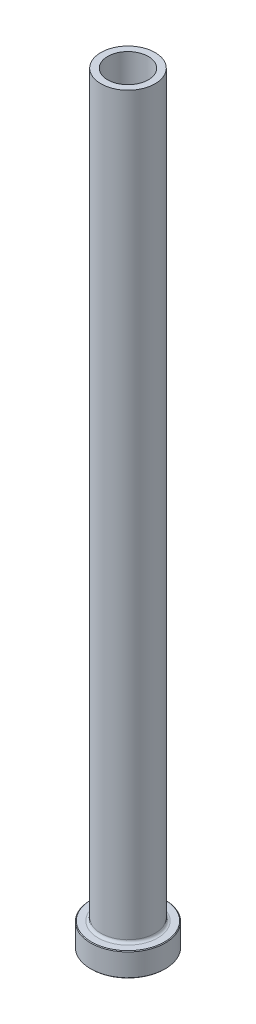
from build123d import *

# Parameters (mm, degrees)
FILLET1_R     = 0.8
CHAMFER1_SIZE = 0.2
CHAMFER3_SIZE = 0.5


with BuildPart() as part:
    # Sketch1 → Revolve1 (revolve)
    with BuildSketch(Plane.XY, mode=Mode.PRIVATE) as revolve1_sk:
        Polygon((-6, 225), (-8, 225), (-8, 7), (-11, 7), (-11, 0), (-6.25, 0), (-6.25, 158), (-6, 170), align=None)
    revolve(revolve1_sk.sketch.rotate(Axis((0, 92.187680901, 0), (0, -1, 0)), 270), axis=Axis((0, 92.187680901, 0), (0, -1, 0)))

    # Fillet1
    fillet1_edges = [part.edges().sort_by_distance(p)[0] for p in [
        (0, 7, -8),
    ]]
    fillet(fillet1_edges, radius=FILLET1_R)

    # Chamfer1
    chamfer1_edges = [part.edges().sort_by_distance(p)[0] for p in [
        (0, 0, -11),
        (0, 7, -11),
    ]]
    chamfer(chamfer1_edges, length=CHAMFER1_SIZE)

    # Chamfer3
    chamfer3_edges = [part.edges().sort_by_distance(p)[0] for p in [
        (0, 0, -6.25),
    ]]
    chamfer(chamfer3_edges, length=CHAMFER3_SIZE)


solid = part.part
